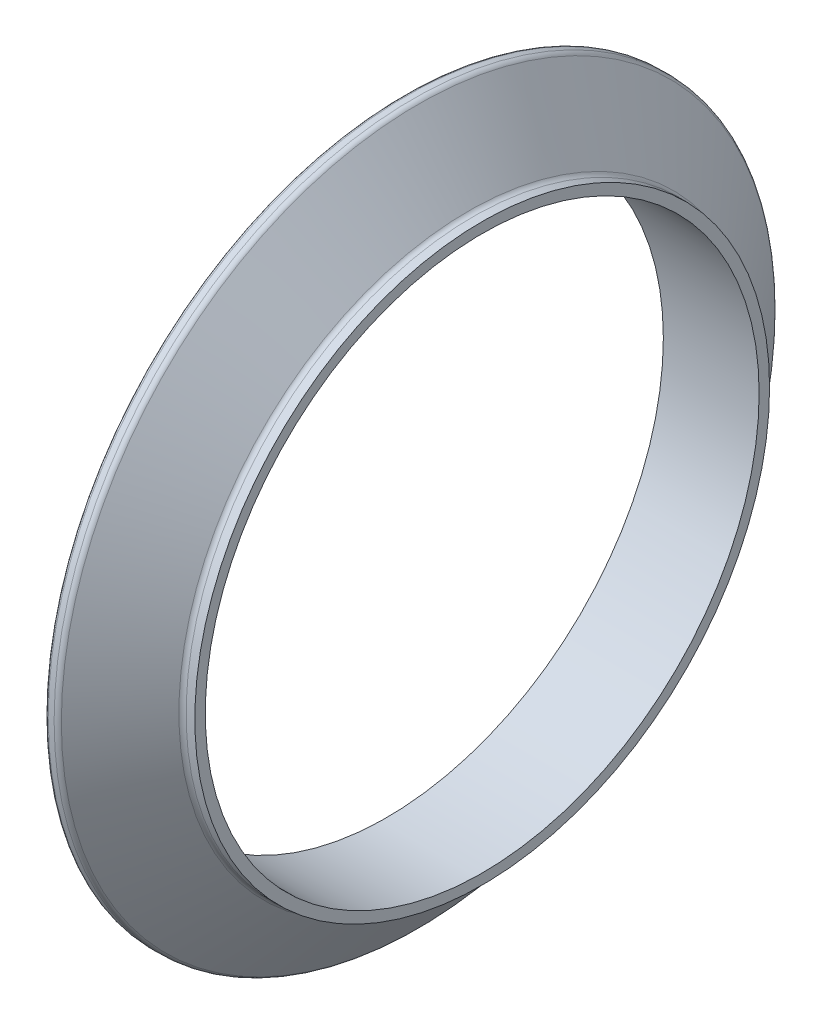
from build123d import *


with BuildPart() as part:
    # Sketch1 → Revolve1 (revolve)
    with BuildSketch(Plane.XY, mode=Mode.PRIVATE) as revolve1_sk:
        with BuildLine():
            Line((0, 73.4314), (-25.4, 73.4314))
            Line((-25.4, 73.4314), (-25.4, 85.9536))
            ThreePointArc((-25.4, 85.9536), (-25.161936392, 86.528336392), (-24.5872, 86.7664))
            Line((-24.5872, 86.7664), (-21.4503, 86.7664))
            ThreePointArc((-21.4503, 86.7664), (-20.875563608, 87.004463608), (-20.6375, 87.5792))
            Line((-20.6375, 87.5792), (-20.6375, 94.4372))
            ThreePointArc((-20.6375, 94.4372), (-20.399436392, 95.011936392), (-19.8247, 95.25))
            Line((-19.8247, 95.25), (-18.260330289, 95.25))
            ThreePointArc((-18.260330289, 95.25), (-17.546324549, 95.081873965), (-16.982353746, 94.6128244))
            Line((-16.982353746, 94.6128244), (-3.5874416, 76.8371756))
            ThreePointArc((-3.5874416, 76.8371756), (-3.023470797, 76.368126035), (-2.309465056, 76.2))
            Line((-2.309465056, 76.2), (0, 76.2))
            Line((0, 76.2), (0, 73.4314))
        make_face()
    revolve(revolve1_sk.sketch.rotate(Axis((0, 0, 0), (-1, 0, 0)), 90), axis=Axis((0, 0, 0), (-1, 0, 0)))


solid = part.part
